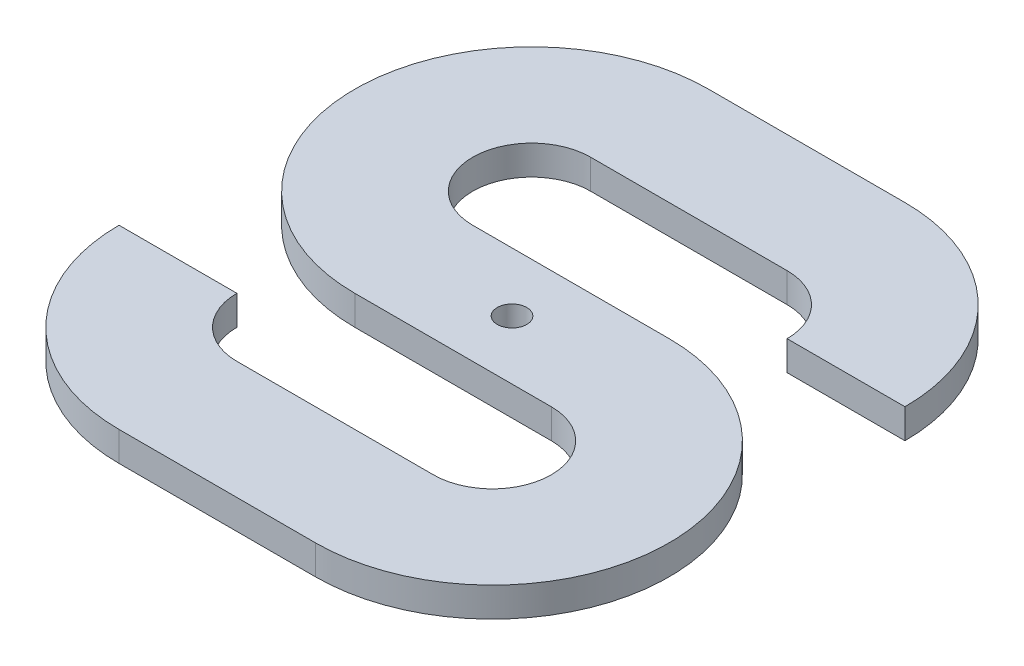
ISO-10303-21;
HEADER;
FILE_DESCRIPTION(('STEP AP214'),'2;1');
FILE_NAME('part.step','',(''),(''),'','','');
FILE_SCHEMA(('AUTOMOTIVE_DESIGN { 1 0 10303 214 1 1 1 1 }'));
ENDSEC;
DATA;
#1=APPLICATION_CONTEXT('core data for automotive mechanical design processes');
#2=APPLICATION_PROTOCOL_DEFINITION('international standard','automotive_design',2000,#1);
#3=PRODUCT_CONTEXT('',#1,'mechanical');
#4=PRODUCT('Part','Part','',(#3));
#5=PRODUCT_RELATED_PRODUCT_CATEGORY('part','',(#4));
#6=PRODUCT_DEFINITION_FORMATION('','',#4);
#7=PRODUCT_DEFINITION_CONTEXT('part definition',#1,'design');
#8=PRODUCT_DEFINITION('design','',#6,#7);
#9=PRODUCT_DEFINITION_SHAPE('','',#8);
#10=(LENGTH_UNIT() NAMED_UNIT(*) SI_UNIT(.MILLI.,.METRE.));
#11=(NAMED_UNIT(*) PLANE_ANGLE_UNIT() SI_UNIT($,.RADIAN.));
#12=(NAMED_UNIT(*) SI_UNIT($,.STERADIAN.) SOLID_ANGLE_UNIT());
#13=UNCERTAINTY_MEASURE_WITH_UNIT(LENGTH_MEASURE(1.E-05),#10,'distance_accuracy_value','');
#14=(GEOMETRIC_REPRESENTATION_CONTEXT(3) GLOBAL_UNCERTAINTY_ASSIGNED_CONTEXT((#13)) GLOBAL_UNIT_ASSIGNED_CONTEXT((#10,
#11,#12)) REPRESENTATION_CONTEXT('',''));
#15=CARTESIAN_POINT('',(0.,0.,0.));
#16=DIRECTION('',(0.,0.,1.));
#17=DIRECTION('',(1.,0.,0.));
#18=AXIS2_PLACEMENT_3D('',#15,#16,#17);
#19=CARTESIAN_POINT('',(18.,3.,-18.));
#20=DIRECTION('',(0.,1.,0.));
#21=DIRECTION('',(0.,0.,1.));
#22=AXIS2_PLACEMENT_3D('',#19,#20,#21);
#23=PLANE('',#22);
#24=CARTESIAN_POINT('',(18.,3.,-18.));
#25=DIRECTION('',(0.,-1.,0.));
#26=DIRECTION('',(0.,0.,1.));
#27=AXIS2_PLACEMENT_3D('',#24,#25,#26);
#28=CIRCLE('',#27,6.);
#29=CARTESIAN_POINT('',(18.,3.,-12.));
#30=VERTEX_POINT('',#29);
#31=CARTESIAN_POINT('',(12.,3.,-18.));
#32=VERTEX_POINT('',#31);
#33=EDGE_CURVE('E196',#30,#32,#28,.T.);
#34=ORIENTED_EDGE('',*,*,#33,.T.);
#35=DIRECTION('',(-1.,0.,0.));
#36=VECTOR('',#35,1.);
#37=CARTESIAN_POINT('',(0.,3.,-18.));
#38=LINE('',#37,#36);
#39=CARTESIAN_POINT('',(0.,3.,-18.));
#40=VERTEX_POINT('',#39);
#41=EDGE_CURVE('E157',#32,#40,#38,.T.);
#42=ORIENTED_EDGE('',*,*,#41,.T.);
#43=CARTESIAN_POINT('',(18.,3.,-18.));
#44=DIRECTION('',(0.,1.,0.));
#45=DIRECTION('',(0.,0.,1.));
#46=AXIS2_PLACEMENT_3D('',#43,#44,#45);
#47=CIRCLE('',#46,18.);
#48=CARTESIAN_POINT('',(18.,3.,0.));
#49=VERTEX_POINT('',#48);
#50=EDGE_CURVE('E199',#40,#49,#47,.T.);
#51=ORIENTED_EDGE('',*,*,#50,.T.);
#52=DIRECTION('',(1.,0.,0.));
#53=VECTOR('',#52,1.);
#54=CARTESIAN_POINT('',(18.,3.,0.));
#55=LINE('',#54,#53);
#56=CARTESIAN_POINT('',(38.,3.,0.));
#57=VERTEX_POINT('',#56);
#58=EDGE_CURVE('E201',#49,#57,#55,.T.);
#59=ORIENTED_EDGE('',*,*,#58,.T.);
#60=CARTESIAN_POINT('',(38.,3.,-18.));
#61=DIRECTION('',(0.,1.,0.));
#62=DIRECTION('',(0.,0.,1.));
#63=AXIS2_PLACEMENT_3D('',#60,#61,#62);
#64=CIRCLE('',#63,18.);
#65=CARTESIAN_POINT('',(38.,3.,-36.));
#66=VERTEX_POINT('',#65);
#67=EDGE_CURVE('E203',#57,#66,#64,.T.);
#68=ORIENTED_EDGE('',*,*,#67,.T.);
#69=DIRECTION('',(-1.,0.,0.));
#70=VECTOR('',#69,1.);
#71=CARTESIAN_POINT('',(18.,3.,-36.));
#72=LINE('',#71,#70);
#73=CARTESIAN_POINT('',(18.,3.,-36.));
#74=VERTEX_POINT('',#73);
#75=EDGE_CURVE('E205',#66,#74,#72,.T.);
#76=ORIENTED_EDGE('',*,*,#75,.T.);
#77=CARTESIAN_POINT('',(18.,3.,-42.));
#78=DIRECTION('',(0.,-1.,0.));
#79=DIRECTION('',(0.,0.,1.));
#80=AXIS2_PLACEMENT_3D('',#77,#78,#79);
#81=CIRCLE('',#80,6.);
#82=CARTESIAN_POINT('',(18.,3.,-48.));
#83=VERTEX_POINT('',#82);
#84=EDGE_CURVE('E207',#74,#83,#81,.T.);
#85=ORIENTED_EDGE('',*,*,#84,.T.);
#86=DIRECTION('',(1.,0.,0.));
#87=VECTOR('',#86,1.);
#88=CARTESIAN_POINT('',(18.,3.,-48.));
#89=LINE('',#88,#87);
#90=CARTESIAN_POINT('',(38.,3.,-48.));
#91=VERTEX_POINT('',#90);
#92=EDGE_CURVE('E209',#83,#91,#89,.T.);
#93=ORIENTED_EDGE('',*,*,#92,.T.);
#94=CARTESIAN_POINT('',(38.,3.,-42.));
#95=DIRECTION('',(0.,-1.,0.));
#96=DIRECTION('',(0.,0.,1.));
#97=AXIS2_PLACEMENT_3D('',#94,#95,#96);
#98=CIRCLE('',#97,6.);
#99=CARTESIAN_POINT('',(44.,3.,-42.));
#100=VERTEX_POINT('',#99);
#101=EDGE_CURVE('E211',#91,#100,#98,.T.);
#102=ORIENTED_EDGE('',*,*,#101,.T.);
#103=DIRECTION('',(1.,0.,0.));
#104=VECTOR('',#103,1.);
#105=CARTESIAN_POINT('',(44.,3.,-42.));
#106=LINE('',#105,#104);
#107=CARTESIAN_POINT('',(56.,3.,-42.));
#108=VERTEX_POINT('',#107);
#109=EDGE_CURVE('E213',#100,#108,#106,.T.);
#110=ORIENTED_EDGE('',*,*,#109,.T.);
#111=CARTESIAN_POINT('',(38.,3.,-42.));
#112=DIRECTION('',(0.,1.,0.));
#113=DIRECTION('',(0.,0.,1.));
#114=AXIS2_PLACEMENT_3D('',#111,#112,#113);
#115=CIRCLE('',#114,18.);
#116=CARTESIAN_POINT('',(38.,3.,-60.));
#117=VERTEX_POINT('',#116);
#118=EDGE_CURVE('E215',#108,#117,#115,.T.);
#119=ORIENTED_EDGE('',*,*,#118,.T.);
#120=DIRECTION('',(-1.,0.,0.));
#121=VECTOR('',#120,1.);
#122=CARTESIAN_POINT('',(18.,3.,-60.));
#123=LINE('',#122,#121);
#124=CARTESIAN_POINT('',(18.,3.,-60.));
#125=VERTEX_POINT('',#124);
#126=EDGE_CURVE('E217',#117,#125,#123,.T.);
#127=ORIENTED_EDGE('',*,*,#126,.T.);
#128=CARTESIAN_POINT('',(18.,3.,-42.));
#129=DIRECTION('',(0.,1.,0.));
#130=DIRECTION('',(0.,0.,1.));
#131=AXIS2_PLACEMENT_3D('',#128,#129,#130);
#132=CIRCLE('',#131,18.);
#133=CARTESIAN_POINT('',(18.,3.,-24.));
#134=VERTEX_POINT('',#133);
#135=EDGE_CURVE('E219',#125,#134,#132,.T.);
#136=ORIENTED_EDGE('',*,*,#135,.T.);
#137=DIRECTION('',(1.,0.,0.));
#138=VECTOR('',#137,1.);
#139=CARTESIAN_POINT('',(18.,3.,-24.));
#140=LINE('',#139,#138);
#141=CARTESIAN_POINT('',(38.,3.,-24.));
#142=VERTEX_POINT('',#141);
#143=EDGE_CURVE('E221',#134,#142,#140,.T.);
#144=ORIENTED_EDGE('',*,*,#143,.T.);
#145=CARTESIAN_POINT('',(38.,3.,-18.));
#146=DIRECTION('',(0.,-1.,0.));
#147=DIRECTION('',(0.,0.,1.));
#148=AXIS2_PLACEMENT_3D('',#145,#146,#147);
#149=CIRCLE('',#148,6.);
#150=CARTESIAN_POINT('',(38.,3.,-12.));
#151=VERTEX_POINT('',#150);
#152=EDGE_CURVE('E50',#142,#151,#149,.T.);
#153=ORIENTED_EDGE('',*,*,#152,.T.);
#154=DIRECTION('',(-1.,0.,0.));
#155=VECTOR('',#154,1.);
#156=CARTESIAN_POINT('',(18.,3.,-12.));
#157=LINE('',#156,#155);
#158=EDGE_CURVE('E45',#151,#30,#157,.T.);
#159=ORIENTED_EDGE('',*,*,#158,.T.);
#160=EDGE_LOOP('',(#34,#42,#51,#59,#68,#76,#85,#93,#102,#110,#119,#127,#136,#144,#153,#159));
#161=FACE_BOUND('',#160,.T.);
#162=CARTESIAN_POINT('',(28.,3.,-30.));
#163=DIRECTION('',(0.,1.,0.));
#164=DIRECTION('',(0.,0.,1.));
#165=AXIS2_PLACEMENT_3D('',#162,#163,#164);
#166=CIRCLE('',#165,1.5);
#167=CARTESIAN_POINT('',(28.,3.,-28.5));
#168=VERTEX_POINT('',#167);
#169=EDGE_CURVE('E162',#168,#168,#166,.T.);
#170=ORIENTED_EDGE('',*,*,#169,.F.);
#171=EDGE_LOOP('',(#170));
#172=FACE_BOUND('',#171,.T.);
#173=ADVANCED_FACE('F30',(#161,#172),#23,.T.);
#174=CARTESIAN_POINT('',(18.,0.,-18.));
#175=DIRECTION('',(0.,1.,0.));
#176=DIRECTION('',(0.,0.,1.));
#177=AXIS2_PLACEMENT_3D('',#174,#175,#176);
#178=PLANE('',#177);
#179=CARTESIAN_POINT('',(18.,0.,-18.));
#180=DIRECTION('',(0.,-1.,0.));
#181=DIRECTION('',(0.,0.,1.));
#182=AXIS2_PLACEMENT_3D('',#179,#180,#181);
#183=CIRCLE('',#182,6.);
#184=CARTESIAN_POINT('',(18.,0.,-12.));
#185=VERTEX_POINT('',#184);
#186=CARTESIAN_POINT('',(12.,0.,-18.));
#187=VERTEX_POINT('',#186);
#188=EDGE_CURVE('E148',#185,#187,#183,.T.);
#189=ORIENTED_EDGE('',*,*,#188,.F.);
#190=DIRECTION('',(-1.,0.,0.));
#191=VECTOR('',#190,1.);
#192=CARTESIAN_POINT('',(18.,0.,-12.));
#193=LINE('',#192,#191);
#194=CARTESIAN_POINT('',(38.,0.,-12.));
#195=VERTEX_POINT('',#194);
#196=EDGE_CURVE('E194',#195,#185,#193,.T.);
#197=ORIENTED_EDGE('',*,*,#196,.F.);
#198=CARTESIAN_POINT('',(38.,0.,-18.));
#199=DIRECTION('',(0.,-1.,0.));
#200=DIRECTION('',(0.,0.,1.));
#201=AXIS2_PLACEMENT_3D('',#198,#199,#200);
#202=CIRCLE('',#201,6.);
#203=CARTESIAN_POINT('',(38.,0.,-24.));
#204=VERTEX_POINT('',#203);
#205=EDGE_CURVE('E192',#204,#195,#202,.T.);
#206=ORIENTED_EDGE('',*,*,#205,.F.);
#207=DIRECTION('',(1.,0.,0.));
#208=VECTOR('',#207,1.);
#209=CARTESIAN_POINT('',(18.,0.,-24.));
#210=LINE('',#209,#208);
#211=CARTESIAN_POINT('',(18.,0.,-24.));
#212=VERTEX_POINT('',#211);
#213=EDGE_CURVE('E190',#212,#204,#210,.T.);
#214=ORIENTED_EDGE('',*,*,#213,.F.);
#215=CARTESIAN_POINT('',(18.,0.,-42.));
#216=DIRECTION('',(0.,1.,0.));
#217=DIRECTION('',(0.,0.,1.));
#218=AXIS2_PLACEMENT_3D('',#215,#216,#217);
#219=CIRCLE('',#218,18.);
#220=CARTESIAN_POINT('',(18.,0.,-60.));
#221=VERTEX_POINT('',#220);
#222=EDGE_CURVE('E188',#221,#212,#219,.T.);
#223=ORIENTED_EDGE('',*,*,#222,.F.);
#224=DIRECTION('',(-1.,0.,0.));
#225=VECTOR('',#224,1.);
#226=CARTESIAN_POINT('',(18.,0.,-60.));
#227=LINE('',#226,#225);
#228=CARTESIAN_POINT('',(38.,0.,-60.));
#229=VERTEX_POINT('',#228);
#230=EDGE_CURVE('E186',#229,#221,#227,.T.);
#231=ORIENTED_EDGE('',*,*,#230,.F.);
#232=CARTESIAN_POINT('',(38.,0.,-42.));
#233=DIRECTION('',(0.,1.,0.));
#234=DIRECTION('',(0.,0.,1.));
#235=AXIS2_PLACEMENT_3D('',#232,#233,#234);
#236=CIRCLE('',#235,18.);
#237=CARTESIAN_POINT('',(56.,0.,-42.));
#238=VERTEX_POINT('',#237);
#239=EDGE_CURVE('E184',#238,#229,#236,.T.);
#240=ORIENTED_EDGE('',*,*,#239,.F.);
#241=DIRECTION('',(1.,0.,0.));
#242=VECTOR('',#241,1.);
#243=CARTESIAN_POINT('',(44.,0.,-42.));
#244=LINE('',#243,#242);
#245=CARTESIAN_POINT('',(44.,0.,-42.));
#246=VERTEX_POINT('',#245);
#247=EDGE_CURVE('E182',#246,#238,#244,.T.);
#248=ORIENTED_EDGE('',*,*,#247,.F.);
#249=CARTESIAN_POINT('',(38.,0.,-42.));
#250=DIRECTION('',(0.,-1.,0.));
#251=DIRECTION('',(0.,0.,1.));
#252=AXIS2_PLACEMENT_3D('',#249,#250,#251);
#253=CIRCLE('',#252,6.);
#254=CARTESIAN_POINT('',(38.,0.,-48.));
#255=VERTEX_POINT('',#254);
#256=EDGE_CURVE('E180',#255,#246,#253,.T.);
#257=ORIENTED_EDGE('',*,*,#256,.F.);
#258=DIRECTION('',(1.,0.,0.));
#259=VECTOR('',#258,1.);
#260=CARTESIAN_POINT('',(18.,0.,-48.));
#261=LINE('',#260,#259);
#262=CARTESIAN_POINT('',(18.,0.,-48.));
#263=VERTEX_POINT('',#262);
#264=EDGE_CURVE('E178',#263,#255,#261,.T.);
#265=ORIENTED_EDGE('',*,*,#264,.F.);
#266=CARTESIAN_POINT('',(18.,0.,-42.));
#267=DIRECTION('',(0.,-1.,0.));
#268=DIRECTION('',(0.,0.,1.));
#269=AXIS2_PLACEMENT_3D('',#266,#267,#268);
#270=CIRCLE('',#269,6.);
#271=CARTESIAN_POINT('',(18.,0.,-36.));
#272=VERTEX_POINT('',#271);
#273=EDGE_CURVE('E176',#272,#263,#270,.T.);
#274=ORIENTED_EDGE('',*,*,#273,.F.);
#275=DIRECTION('',(-1.,0.,0.));
#276=VECTOR('',#275,1.);
#277=CARTESIAN_POINT('',(18.,0.,-36.));
#278=LINE('',#277,#276);
#279=CARTESIAN_POINT('',(38.,0.,-36.));
#280=VERTEX_POINT('',#279);
#281=EDGE_CURVE('E174',#280,#272,#278,.T.);
#282=ORIENTED_EDGE('',*,*,#281,.F.);
#283=CARTESIAN_POINT('',(38.,0.,-18.));
#284=DIRECTION('',(0.,1.,0.));
#285=DIRECTION('',(0.,0.,1.));
#286=AXIS2_PLACEMENT_3D('',#283,#284,#285);
#287=CIRCLE('',#286,18.);
#288=CARTESIAN_POINT('',(38.,0.,0.));
#289=VERTEX_POINT('',#288);
#290=EDGE_CURVE('E172',#289,#280,#287,.T.);
#291=ORIENTED_EDGE('',*,*,#290,.F.);
#292=DIRECTION('',(1.,0.,0.));
#293=VECTOR('',#292,1.);
#294=CARTESIAN_POINT('',(18.,0.,0.));
#295=LINE('',#294,#293);
#296=CARTESIAN_POINT('',(18.,0.,0.));
#297=VERTEX_POINT('',#296);
#298=EDGE_CURVE('E170',#297,#289,#295,.T.);
#299=ORIENTED_EDGE('',*,*,#298,.F.);
#300=CARTESIAN_POINT('',(18.,0.,-18.));
#301=DIRECTION('',(0.,1.,0.));
#302=DIRECTION('',(0.,0.,1.));
#303=AXIS2_PLACEMENT_3D('',#300,#301,#302);
#304=CIRCLE('',#303,18.);
#305=CARTESIAN_POINT('',(0.,0.,-18.));
#306=VERTEX_POINT('',#305);
#307=EDGE_CURVE('E150',#306,#297,#304,.T.);
#308=ORIENTED_EDGE('',*,*,#307,.F.);
#309=DIRECTION('',(-1.,0.,0.));
#310=VECTOR('',#309,1.);
#311=CARTESIAN_POINT('',(0.,0.,-18.));
#312=LINE('',#311,#310);
#313=EDGE_CURVE('E143',#187,#306,#312,.T.);
#314=ORIENTED_EDGE('',*,*,#313,.F.);
#315=EDGE_LOOP('',(#189,#197,#206,#214,#223,#231,#240,#248,#257,#265,#274,#282,#291,#299,#308,#314));
#316=FACE_BOUND('',#315,.T.);
#317=CARTESIAN_POINT('',(28.,0.,-30.));
#318=DIRECTION('',(0.,1.,0.));
#319=DIRECTION('',(0.,0.,1.));
#320=AXIS2_PLACEMENT_3D('',#317,#318,#319);
#321=CIRCLE('',#320,1.5);
#322=CARTESIAN_POINT('',(28.,0.,-28.5));
#323=VERTEX_POINT('',#322);
#324=EDGE_CURVE('E165',#323,#323,#321,.T.);
#325=ORIENTED_EDGE('',*,*,#324,.T.);
#326=EDGE_LOOP('',(#325));
#327=FACE_BOUND('',#326,.T.);
#328=ADVANCED_FACE('F144',(#316,#327),#178,.F.);
#329=CARTESIAN_POINT('',(18.,3.,-18.));
#330=DIRECTION('',(0.,-1.,0.));
#331=DIRECTION('',(0.,0.,-1.));
#332=AXIS2_PLACEMENT_3D('',#329,#330,#331);
#333=CYLINDRICAL_SURFACE('',#332,6.);
#334=ORIENTED_EDGE('',*,*,#188,.T.);
#335=DIRECTION('',(0.,-1.,0.));
#336=VECTOR('',#335,1.);
#337=CARTESIAN_POINT('',(12.,3.,-18.));
#338=LINE('',#337,#336);
#339=EDGE_CURVE('E11',#32,#187,#338,.T.);
#340=ORIENTED_EDGE('',*,*,#339,.F.);
#341=ORIENTED_EDGE('',*,*,#33,.F.);
#342=DIRECTION('',(0.,-1.,0.));
#343=VECTOR('',#342,1.);
#344=CARTESIAN_POINT('',(18.,3.,-12.));
#345=LINE('',#344,#343);
#346=EDGE_CURVE('E161',#30,#185,#345,.T.);
#347=ORIENTED_EDGE('',*,*,#346,.T.);
#348=EDGE_LOOP('',(#334,#340,#341,#347));
#349=FACE_BOUND('',#348,.T.);
#350=ADVANCED_FACE('F32',(#349),#333,.F.);
#351=CARTESIAN_POINT('',(0.,3.,-18.));
#352=DIRECTION('',(0.,0.,1.));
#353=DIRECTION('',(1.,0.,0.));
#354=AXIS2_PLACEMENT_3D('',#351,#352,#353);
#355=PLANE('',#354);
#356=ORIENTED_EDGE('',*,*,#313,.T.);
#357=DIRECTION('',(0.,-1.,0.));
#358=VECTOR('',#357,1.);
#359=CARTESIAN_POINT('',(0.,3.,-18.));
#360=LINE('',#359,#358);
#361=EDGE_CURVE('E38',#40,#306,#360,.T.);
#362=ORIENTED_EDGE('',*,*,#361,.F.);
#363=ORIENTED_EDGE('',*,*,#41,.F.);
#364=ORIENTED_EDGE('',*,*,#339,.T.);
#365=EDGE_LOOP('',(#356,#362,#363,#364));
#366=FACE_BOUND('',#365,.T.);
#367=ADVANCED_FACE('F156',(#366),#355,.F.);
#368=CARTESIAN_POINT('',(18.,3.,-18.));
#369=DIRECTION('',(0.,-1.,0.));
#370=DIRECTION('',(0.,0.,-1.));
#371=AXIS2_PLACEMENT_3D('',#368,#369,#370);
#372=CYLINDRICAL_SURFACE('',#371,18.);
#373=ORIENTED_EDGE('',*,*,#307,.T.);
#374=DIRECTION('',(0.,-1.,0.));
#375=VECTOR('',#374,1.);
#376=CARTESIAN_POINT('',(18.,3.,0.));
#377=LINE('',#376,#375);
#378=EDGE_CURVE('E262',#49,#297,#377,.T.);
#379=ORIENTED_EDGE('',*,*,#378,.F.);
#380=ORIENTED_EDGE('',*,*,#50,.F.);
#381=ORIENTED_EDGE('',*,*,#361,.T.);
#382=EDGE_LOOP('',(#373,#379,#380,#381));
#383=FACE_BOUND('',#382,.T.);
#384=ADVANCED_FACE('F266',(#383),#372,.T.);
#385=CARTESIAN_POINT('',(18.,3.,0.));
#386=DIRECTION('',(0.,0.,-1.));
#387=DIRECTION('',(-1.,0.,0.));
#388=AXIS2_PLACEMENT_3D('',#385,#386,#387);
#389=PLANE('',#388);
#390=ORIENTED_EDGE('',*,*,#298,.T.);
#391=DIRECTION('',(0.,-1.,0.));
#392=VECTOR('',#391,1.);
#393=CARTESIAN_POINT('',(38.,3.,0.));
#394=LINE('',#393,#392);
#395=EDGE_CURVE('E259',#57,#289,#394,.T.);
#396=ORIENTED_EDGE('',*,*,#395,.F.);
#397=ORIENTED_EDGE('',*,*,#58,.F.);
#398=ORIENTED_EDGE('',*,*,#378,.T.);
#399=EDGE_LOOP('',(#390,#396,#397,#398));
#400=FACE_BOUND('',#399,.T.);
#401=ADVANCED_FACE('F274',(#400),#389,.F.);
#402=CARTESIAN_POINT('',(38.,3.,-18.));
#403=DIRECTION('',(0.,-1.,0.));
#404=DIRECTION('',(0.,0.,-1.));
#405=AXIS2_PLACEMENT_3D('',#402,#403,#404);
#406=CYLINDRICAL_SURFACE('',#405,18.);
#407=ORIENTED_EDGE('',*,*,#290,.T.);
#408=DIRECTION('',(0.,-1.,0.));
#409=VECTOR('',#408,1.);
#410=CARTESIAN_POINT('',(38.,3.,-36.));
#411=LINE('',#410,#409);
#412=EDGE_CURVE('E256',#66,#280,#411,.T.);
#413=ORIENTED_EDGE('',*,*,#412,.F.);
#414=ORIENTED_EDGE('',*,*,#67,.F.);
#415=ORIENTED_EDGE('',*,*,#395,.T.);
#416=EDGE_LOOP('',(#407,#413,#414,#415));
#417=FACE_BOUND('',#416,.T.);
#418=ADVANCED_FACE('F277',(#417),#406,.T.);
#419=CARTESIAN_POINT('',(18.,3.,-36.));
#420=DIRECTION('',(0.,0.,1.));
#421=DIRECTION('',(1.,0.,0.));
#422=AXIS2_PLACEMENT_3D('',#419,#420,#421);
#423=PLANE('',#422);
#424=ORIENTED_EDGE('',*,*,#281,.T.);
#425=DIRECTION('',(0.,-1.,0.));
#426=VECTOR('',#425,1.);
#427=CARTESIAN_POINT('',(18.,3.,-36.));
#428=LINE('',#427,#426);
#429=EDGE_CURVE('E253',#74,#272,#428,.T.);
#430=ORIENTED_EDGE('',*,*,#429,.F.);
#431=ORIENTED_EDGE('',*,*,#75,.F.);
#432=ORIENTED_EDGE('',*,*,#412,.T.);
#433=EDGE_LOOP('',(#424,#430,#431,#432));
#434=FACE_BOUND('',#433,.T.);
#435=ADVANCED_FACE('F282',(#434),#423,.F.);
#436=CARTESIAN_POINT('',(18.,3.,-42.));
#437=DIRECTION('',(0.,-1.,0.));
#438=DIRECTION('',(0.,0.,-1.));
#439=AXIS2_PLACEMENT_3D('',#436,#437,#438);
#440=CYLINDRICAL_SURFACE('',#439,6.);
#441=ORIENTED_EDGE('',*,*,#273,.T.);
#442=DIRECTION('',(0.,-1.,0.));
#443=VECTOR('',#442,1.);
#444=CARTESIAN_POINT('',(18.,3.,-48.));
#445=LINE('',#444,#443);
#446=EDGE_CURVE('E250',#83,#263,#445,.T.);
#447=ORIENTED_EDGE('',*,*,#446,.F.);
#448=ORIENTED_EDGE('',*,*,#84,.F.);
#449=ORIENTED_EDGE('',*,*,#429,.T.);
#450=EDGE_LOOP('',(#441,#447,#448,#449));
#451=FACE_BOUND('',#450,.T.);
#452=ADVANCED_FACE('F288',(#451),#440,.F.);
#453=CARTESIAN_POINT('',(18.,3.,-48.));
#454=DIRECTION('',(0.,0.,-1.));
#455=DIRECTION('',(-1.,0.,0.));
#456=AXIS2_PLACEMENT_3D('',#453,#454,#455);
#457=PLANE('',#456);
#458=ORIENTED_EDGE('',*,*,#264,.T.);
#459=DIRECTION('',(0.,-1.,0.));
#460=VECTOR('',#459,1.);
#461=CARTESIAN_POINT('',(38.,3.,-48.));
#462=LINE('',#461,#460);
#463=EDGE_CURVE('E247',#91,#255,#462,.T.);
#464=ORIENTED_EDGE('',*,*,#463,.F.);
#465=ORIENTED_EDGE('',*,*,#92,.F.);
#466=ORIENTED_EDGE('',*,*,#446,.T.);
#467=EDGE_LOOP('',(#458,#464,#465,#466));
#468=FACE_BOUND('',#467,.T.);
#469=ADVANCED_FACE('F292',(#468),#457,.F.);
#470=CARTESIAN_POINT('',(38.,3.,-42.));
#471=DIRECTION('',(0.,-1.,0.));
#472=DIRECTION('',(0.,0.,-1.));
#473=AXIS2_PLACEMENT_3D('',#470,#471,#472);
#474=CYLINDRICAL_SURFACE('',#473,6.);
#475=ORIENTED_EDGE('',*,*,#256,.T.);
#476=DIRECTION('',(0.,-1.,0.));
#477=VECTOR('',#476,1.);
#478=CARTESIAN_POINT('',(44.,3.,-42.));
#479=LINE('',#478,#477);
#480=EDGE_CURVE('E244',#100,#246,#479,.T.);
#481=ORIENTED_EDGE('',*,*,#480,.F.);
#482=ORIENTED_EDGE('',*,*,#101,.F.);
#483=ORIENTED_EDGE('',*,*,#463,.T.);
#484=EDGE_LOOP('',(#475,#481,#482,#483));
#485=FACE_BOUND('',#484,.T.);
#486=ADVANCED_FACE('F297',(#485),#474,.F.);
#487=CARTESIAN_POINT('',(44.,3.,-42.));
#488=DIRECTION('',(0.,0.,-1.));
#489=DIRECTION('',(-1.,0.,0.));
#490=AXIS2_PLACEMENT_3D('',#487,#488,#489);
#491=PLANE('',#490);
#492=ORIENTED_EDGE('',*,*,#247,.T.);
#493=DIRECTION('',(0.,-1.,0.));
#494=VECTOR('',#493,1.);
#495=CARTESIAN_POINT('',(56.,3.,-42.));
#496=LINE('',#495,#494);
#497=EDGE_CURVE('E241',#108,#238,#496,.T.);
#498=ORIENTED_EDGE('',*,*,#497,.F.);
#499=ORIENTED_EDGE('',*,*,#109,.F.);
#500=ORIENTED_EDGE('',*,*,#480,.T.);
#501=EDGE_LOOP('',(#492,#498,#499,#500));
#502=FACE_BOUND('',#501,.T.);
#503=ADVANCED_FACE('F303',(#502),#491,.F.);
#504=CARTESIAN_POINT('',(38.,3.,-42.));
#505=DIRECTION('',(0.,-1.,0.));
#506=DIRECTION('',(0.,0.,-1.));
#507=AXIS2_PLACEMENT_3D('',#504,#505,#506);
#508=CYLINDRICAL_SURFACE('',#507,18.);
#509=ORIENTED_EDGE('',*,*,#239,.T.);
#510=DIRECTION('',(0.,-1.,0.));
#511=VECTOR('',#510,1.);
#512=CARTESIAN_POINT('',(38.,3.,-60.));
#513=LINE('',#512,#511);
#514=EDGE_CURVE('E238',#117,#229,#513,.T.);
#515=ORIENTED_EDGE('',*,*,#514,.F.);
#516=ORIENTED_EDGE('',*,*,#118,.F.);
#517=ORIENTED_EDGE('',*,*,#497,.T.);
#518=EDGE_LOOP('',(#509,#515,#516,#517));
#519=FACE_BOUND('',#518,.T.);
#520=ADVANCED_FACE('F307',(#519),#508,.T.);
#521=CARTESIAN_POINT('',(18.,3.,-60.));
#522=DIRECTION('',(0.,0.,1.));
#523=DIRECTION('',(1.,0.,0.));
#524=AXIS2_PLACEMENT_3D('',#521,#522,#523);
#525=PLANE('',#524);
#526=ORIENTED_EDGE('',*,*,#230,.T.);
#527=DIRECTION('',(0.,-1.,0.));
#528=VECTOR('',#527,1.);
#529=CARTESIAN_POINT('',(18.,3.,-60.));
#530=LINE('',#529,#528);
#531=EDGE_CURVE('E235',#125,#221,#530,.T.);
#532=ORIENTED_EDGE('',*,*,#531,.F.);
#533=ORIENTED_EDGE('',*,*,#126,.F.);
#534=ORIENTED_EDGE('',*,*,#514,.T.);
#535=EDGE_LOOP('',(#526,#532,#533,#534));
#536=FACE_BOUND('',#535,.T.);
#537=ADVANCED_FACE('F312',(#536),#525,.F.);
#538=CARTESIAN_POINT('',(18.,3.,-42.));
#539=DIRECTION('',(0.,-1.,0.));
#540=DIRECTION('',(0.,0.,-1.));
#541=AXIS2_PLACEMENT_3D('',#538,#539,#540);
#542=CYLINDRICAL_SURFACE('',#541,18.);
#543=ORIENTED_EDGE('',*,*,#222,.T.);
#544=DIRECTION('',(0.,-1.,0.));
#545=VECTOR('',#544,1.);
#546=CARTESIAN_POINT('',(18.,3.,-24.));
#547=LINE('',#546,#545);
#548=EDGE_CURVE('E232',#134,#212,#547,.T.);
#549=ORIENTED_EDGE('',*,*,#548,.F.);
#550=ORIENTED_EDGE('',*,*,#135,.F.);
#551=ORIENTED_EDGE('',*,*,#531,.T.);
#552=EDGE_LOOP('',(#543,#549,#550,#551));
#553=FACE_BOUND('',#552,.T.);
#554=ADVANCED_FACE('F318',(#553),#542,.T.);
#555=CARTESIAN_POINT('',(18.,3.,-24.));
#556=DIRECTION('',(0.,0.,-1.));
#557=DIRECTION('',(-1.,0.,0.));
#558=AXIS2_PLACEMENT_3D('',#555,#556,#557);
#559=PLANE('',#558);
#560=ORIENTED_EDGE('',*,*,#213,.T.);
#561=DIRECTION('',(0.,-1.,0.));
#562=VECTOR('',#561,1.);
#563=CARTESIAN_POINT('',(38.,3.,-24.));
#564=LINE('',#563,#562);
#565=EDGE_CURVE('E229',#142,#204,#564,.T.);
#566=ORIENTED_EDGE('',*,*,#565,.F.);
#567=ORIENTED_EDGE('',*,*,#143,.F.);
#568=ORIENTED_EDGE('',*,*,#548,.T.);
#569=EDGE_LOOP('',(#560,#566,#567,#568));
#570=FACE_BOUND('',#569,.T.);
#571=ADVANCED_FACE('F322',(#570),#559,.F.);
#572=CARTESIAN_POINT('',(38.,3.,-18.));
#573=DIRECTION('',(0.,-1.,0.));
#574=DIRECTION('',(0.,0.,-1.));
#575=AXIS2_PLACEMENT_3D('',#572,#573,#574);
#576=CYLINDRICAL_SURFACE('',#575,6.);
#577=ORIENTED_EDGE('',*,*,#205,.T.);
#578=DIRECTION('',(0.,-1.,0.));
#579=VECTOR('',#578,1.);
#580=CARTESIAN_POINT('',(38.,3.,-12.));
#581=LINE('',#580,#579);
#582=EDGE_CURVE('E226',#151,#195,#581,.T.);
#583=ORIENTED_EDGE('',*,*,#582,.F.);
#584=ORIENTED_EDGE('',*,*,#152,.F.);
#585=ORIENTED_EDGE('',*,*,#565,.T.);
#586=EDGE_LOOP('',(#577,#583,#584,#585));
#587=FACE_BOUND('',#586,.T.);
#588=ADVANCED_FACE('F325',(#587),#576,.F.);
#589=CARTESIAN_POINT('',(18.,3.,-12.));
#590=DIRECTION('',(0.,0.,1.));
#591=DIRECTION('',(1.,0.,0.));
#592=AXIS2_PLACEMENT_3D('',#589,#590,#591);
#593=PLANE('',#592);
#594=ORIENTED_EDGE('',*,*,#196,.T.);
#595=ORIENTED_EDGE('',*,*,#346,.F.);
#596=ORIENTED_EDGE('',*,*,#158,.F.);
#597=ORIENTED_EDGE('',*,*,#582,.T.);
#598=EDGE_LOOP('',(#594,#595,#596,#597));
#599=FACE_BOUND('',#598,.T.);
#600=ADVANCED_FACE('F327',(#599),#593,.F.);
#601=CARTESIAN_POINT('',(28.,3.,-30.));
#602=DIRECTION('',(0.,-1.,0.));
#603=DIRECTION('',(0.,0.,-1.));
#604=AXIS2_PLACEMENT_3D('',#601,#602,#603);
#605=CYLINDRICAL_SURFACE('',#604,1.5);
#606=ORIENTED_EDGE('',*,*,#169,.T.);
#607=EDGE_LOOP('',(#606));
#608=FACE_BOUND('',#607,.T.);
#609=ORIENTED_EDGE('',*,*,#324,.F.);
#610=EDGE_LOOP('',(#609));
#611=FACE_BOUND('',#610,.T.);
#612=ADVANCED_FACE('F329',(#608,#611),#605,.F.);
#613=CLOSED_SHELL('',(#173,#328,#350,#367,#384,#401,#418,#435,#452,#469,#486,#503,#520,#537,
#554,#571,#588,#600,#612));
#614=MANIFOLD_SOLID_BREP('B2',#613);
#615=ADVANCED_BREP_SHAPE_REPRESENTATION('',(#18,#614),#14);
#616=SHAPE_DEFINITION_REPRESENTATION(#9,#615);
ENDSEC;
END-ISO-10303-21;
